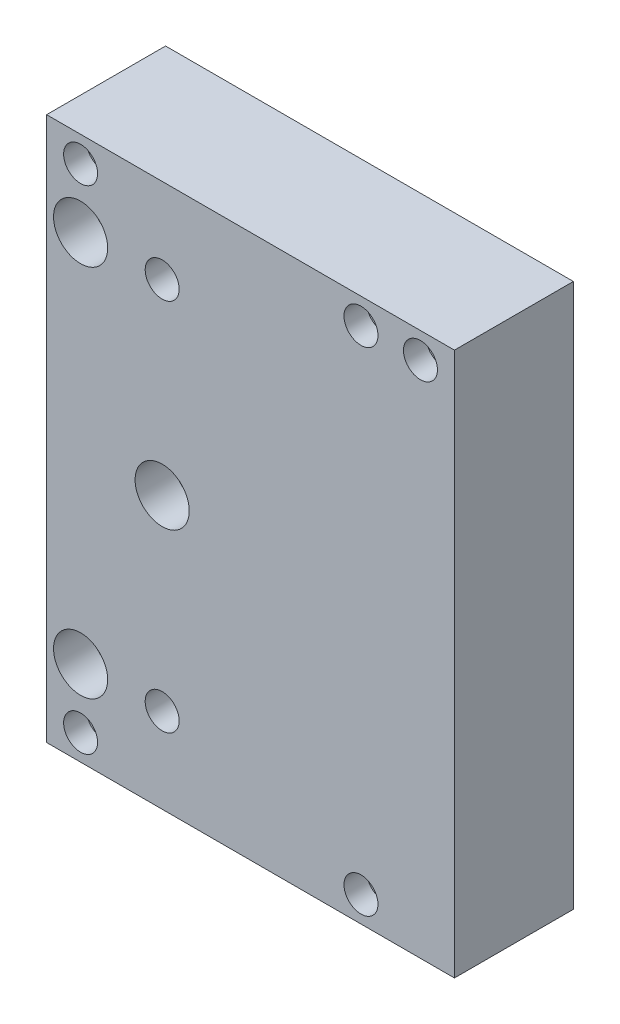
from build123d import *

# Parameters (mm, degrees)
SKETCH1_W           = 152.4
SKETCH1_H           = 203.2
BOSS_EXTRUDE1_DEPTH = 44.45
HOLE1_D             = 7.9375
HOLE1_CBORE_D       = 12.7
HOLE1_CBORE_DEPTH   = 8.4836
HOLE12_D            = 12.7
HOLE13_D            = 13.4874
HOLE13_CBORE_D      = 20.2438
HOLE13_CBORE_DEPTH  = 14.224


with BuildPart() as part:
    # Sketch1 → Boss-Extrude1 (new body)
    with BuildSketch(Plane.XY):
        with Locations((20.32, 0)):
            Rectangle(SKETCH1_W, SKETCH1_H)
    extrude(amount=BOSS_EXTRUDE1_DEPTH)

    # Hole1 (through all)
    with Locations(Plane(origin=(81.403112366, 101.629945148, 44.45), x_dir=(1, 0, 0), z_dir=(0, 0, 1))):
        with Locations((2.416887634, -9.605745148), (-124.583112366, -9.605745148), (-19.808112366, -9.605745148), (-19.808112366, -193.654145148), (-124.583112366, -193.654145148)):
            CounterBoreHole(HOLE1_D / 2, HOLE1_CBORE_D / 2, HOLE1_CBORE_DEPTH)

    # Hole12 (through all)
    with Locations(Plane(origin=(-9.045739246, 80.451140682, 0), x_dir=(-1, 0, 0), z_dir=(0, 0, -1))):
        with Locations((3.654260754, -10.601140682), (3.654260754, -150.301140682)):
            Hole(HOLE12_D / 2)

    # Hole13 (through all)
    with Locations(Plane(origin=(-56.049107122, -68.915000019, 44.45), x_dir=(1, 0, 0), z_dir=(0, 0, 1))):
        with Locations((12.869107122, -0.934999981), (43.349107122, 68.915000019), (12.869107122, 138.765000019)):
            CounterBoreHole(HOLE13_D / 2, HOLE13_CBORE_D / 2, HOLE13_CBORE_DEPTH)


solid = part.part
